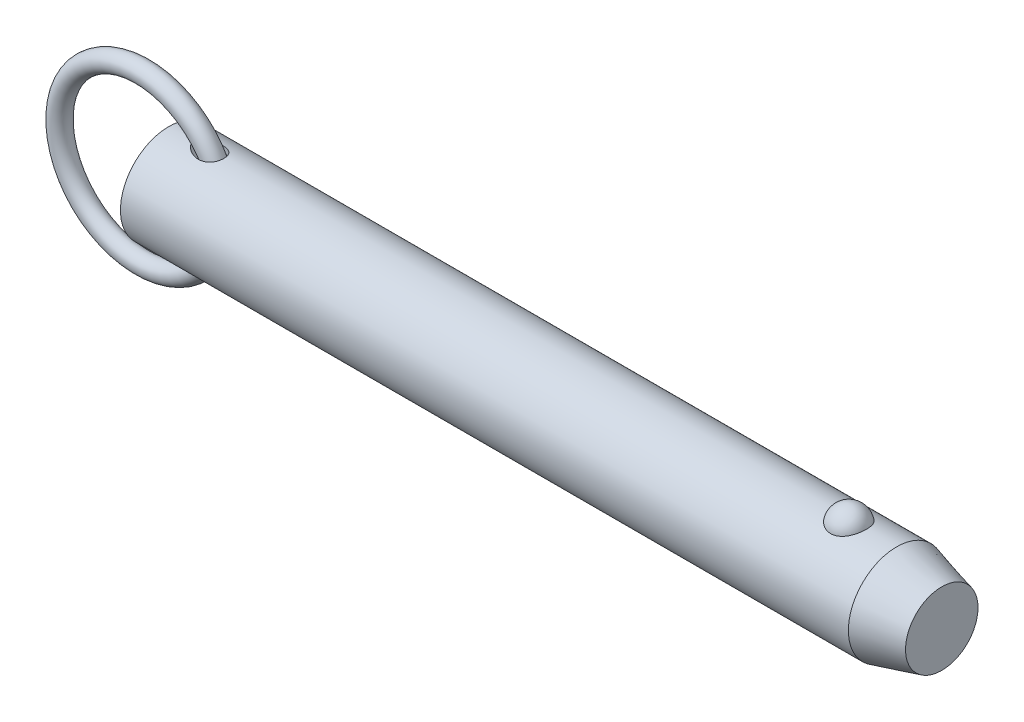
ISO-10303-21;
HEADER;
FILE_DESCRIPTION(('STEP AP214'),'2;1');
FILE_NAME('part.step','',(''),(''),'','','');
FILE_SCHEMA(('AUTOMOTIVE_DESIGN { 1 0 10303 214 1 1 1 1 }'));
ENDSEC;
DATA;
#1=APPLICATION_CONTEXT('core data for automotive mechanical design processes');
#2=APPLICATION_PROTOCOL_DEFINITION('international standard','automotive_design',2000,#1);
#3=PRODUCT_CONTEXT('',#1,'mechanical');
#4=PRODUCT('Part','Part','',(#3));
#5=PRODUCT_RELATED_PRODUCT_CATEGORY('part','',(#4));
#6=PRODUCT_DEFINITION_FORMATION('','',#4);
#7=PRODUCT_DEFINITION_CONTEXT('part definition',#1,'design');
#8=PRODUCT_DEFINITION('design','',#6,#7);
#9=PRODUCT_DEFINITION_SHAPE('','',#8);
#10=(LENGTH_UNIT() NAMED_UNIT(*) SI_UNIT(.MILLI.,.METRE.));
#11=(NAMED_UNIT(*) PLANE_ANGLE_UNIT() SI_UNIT($,.RADIAN.));
#12=(NAMED_UNIT(*) SI_UNIT($,.STERADIAN.) SOLID_ANGLE_UNIT());
#13=UNCERTAINTY_MEASURE_WITH_UNIT(LENGTH_MEASURE(1.E-05),#10,'distance_accuracy_value','');
#14=(GEOMETRIC_REPRESENTATION_CONTEXT(3) GLOBAL_UNCERTAINTY_ASSIGNED_CONTEXT((#13)) GLOBAL_UNIT_ASSIGNED_CONTEXT((#10,
#11,#12)) REPRESENTATION_CONTEXT('',''));
#15=CARTESIAN_POINT('',(0.,0.,0.));
#16=DIRECTION('',(0.,0.,1.));
#17=DIRECTION('',(1.,0.,0.));
#18=AXIS2_PLACEMENT_3D('',#15,#16,#17);
#19=CARTESIAN_POINT('',(-6.08699288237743,0.,0.));
#20=DIRECTION('',(0.,0.,1.));
#21=DIRECTION('',(1.,0.,0.));
#22=AXIS2_PLACEMENT_3D('',#19,#20,#21);
#23=TOROIDAL_SURFACE('',#22,19.05,2.223);
#24=CARTESIAN_POINT('',(15.1860071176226,0.,0.));
#25=VERTEX_POINT('',#24);
#26=VERTEX_LOOP('',#25);
#27=FACE_BOUND('',#26,.T.);
#28=ADVANCED_FACE('P0_F12',(#27),#23,.T.);
#29=CLOSED_SHELL('',(#28));
#30=MANIFOLD_SOLID_BREP('P0_B1',#29);
#31=CARTESIAN_POINT('',(0.,0.,0.));
#32=DIRECTION('',(1.,0.,0.));
#33=DIRECTION('',(0.,0.,-1.));
#34=AXIS2_PLACEMENT_3D('',#31,#32,#33);
#35=CYLINDRICAL_SURFACE('',#34,11.115);
#36=CARTESIAN_POINT('',(6.41405181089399,11.0227946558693,-1.4287136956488));
#37=CARTESIAN_POINT('',(6.49338916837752,11.0115377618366,-1.51556642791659));
#38=CARTESIAN_POINT('',(6.5776546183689,10.9998263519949,-1.59789397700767));
#39=CARTESIAN_POINT('',(6.75386647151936,10.9760304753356,-1.75391400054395));
#40=CARTESIAN_POINT('',(6.84582247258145,10.9639455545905,-1.82759540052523));
#41=CARTESIAN_POINT('',(7.03627827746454,10.9397989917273,-1.96698954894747));
#42=CARTESIAN_POINT('',(7.1348083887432,10.9277377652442,-2.03266078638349));
#43=CARTESIAN_POINT('',(7.33681032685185,10.9041015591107,-2.1558582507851));
#44=CARTESIAN_POINT('',(7.44028007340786,10.8925263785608,-2.21338786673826));
#45=CARTESIAN_POINT('',(7.64386117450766,10.8710104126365,-2.31666528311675));
#46=CARTESIAN_POINT('',(7.74368989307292,10.8610119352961,-2.36295942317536));
#47=CARTESIAN_POINT('',(7.94637195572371,10.8420168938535,-2.44863486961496));
#48=CARTESIAN_POINT('',(8.0492261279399,10.8330206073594,-2.48801426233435));
#49=CARTESIAN_POINT('',(8.3611557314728,10.807980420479,-2.59542730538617));
#50=CARTESIAN_POINT('',(8.57411849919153,10.7938278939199,-2.65299817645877));
#51=CARTESIAN_POINT('',(9.00825016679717,10.7725818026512,-2.73800108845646));
#52=CARTESIAN_POINT('',(9.22947335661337,10.7655491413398,-2.76517330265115));
#53=CARTESIAN_POINT('',(9.6736814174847,10.7605872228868,-2.78445308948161));
#54=CARTESIAN_POINT('',(9.89666486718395,10.7626512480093,-2.77658653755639));
#55=CARTESIAN_POINT('',(10.2950172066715,10.7754452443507,-2.72644436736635));
#56=CARTESIAN_POINT('',(10.4712789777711,10.7844280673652,-2.69109376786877));
#57=CARTESIAN_POINT('',(10.7292776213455,10.8024982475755,-2.61722365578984));
#58=CARTESIAN_POINT('',(10.8142337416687,10.8092901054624,-2.58911576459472));
#59=CARTESIAN_POINT('',(10.9813218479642,10.8242580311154,-2.52581287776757));
#60=CARTESIAN_POINT('',(11.0634550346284,10.8324335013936,-2.49062094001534));
#61=CARTESIAN_POINT('',(11.2247418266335,10.8500287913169,-2.41281958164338));
#62=CARTESIAN_POINT('',(11.3038694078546,10.8594572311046,-2.37015806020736));
#63=CARTESIAN_POINT('',(11.4576781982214,10.8792243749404,-2.27770403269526));
#64=CARTESIAN_POINT('',(11.5323615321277,10.8895626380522,-2.22791497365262));
#65=CARTESIAN_POINT('',(11.6765388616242,10.9108113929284,-2.12140590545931));
#66=CARTESIAN_POINT('',(11.7460329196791,10.9217218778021,-2.06468597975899));
#67=CARTESIAN_POINT('',(11.8790597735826,10.9437207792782,-1.94471764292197));
#68=CARTESIAN_POINT('',(11.9425932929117,10.9548091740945,-1.88147002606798));
#69=CARTESIAN_POINT('',(12.109388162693,10.9851999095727,-1.69784918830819));
#70=CARTESIAN_POINT('',(12.205655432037,11.0042655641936,-1.57093023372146));
#71=CARTESIAN_POINT('',(12.374151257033,11.0393391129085,-1.3017676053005));
#72=CARTESIAN_POINT('',(12.4463875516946,11.0553479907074,-1.15952888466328));
#73=CARTESIAN_POINT('',(12.5615818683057,11.0816338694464,-0.871972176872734));
#74=CARTESIAN_POINT('',(12.6058896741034,11.0921698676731,-0.727217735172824));
#75=CARTESIAN_POINT('',(12.6699315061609,11.1075802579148,-0.432089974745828));
#76=CARTESIAN_POINT('',(12.6896681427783,11.1124552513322,-0.281717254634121));
#77=CARTESIAN_POINT('',(12.704022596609,11.1159901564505,0.0188164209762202));
#78=CARTESIAN_POINT('',(12.6988836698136,11.1147102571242,0.168965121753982));
#79=CARTESIAN_POINT('',(12.6641681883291,11.1062126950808,0.466238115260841));
#80=CARTESIAN_POINT('',(12.6345920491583,11.0989951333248,0.61336245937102));
#81=CARTESIAN_POINT('',(12.5517453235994,11.0794095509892,0.900330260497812));
#82=CARTESIAN_POINT('',(12.4984878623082,11.0670443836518,1.0401777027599));
#83=CARTESIAN_POINT('',(12.3696588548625,11.0385082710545,1.308745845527));
#84=CARTESIAN_POINT('',(12.2940887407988,11.0223375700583,1.43746725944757));
#85=CARTESIAN_POINT('',(12.122380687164,10.987872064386,1.68079704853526));
#86=CARTESIAN_POINT('',(12.0261637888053,10.969569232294,1.79534850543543));
#87=CARTESIAN_POINT('',(11.8161707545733,10.932836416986,2.00695695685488));
#88=CARTESIAN_POINT('',(11.7023941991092,10.9144064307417,2.10401353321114));
#89=CARTESIAN_POINT('',(11.4575656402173,10.8788057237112,2.28105326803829));
#90=CARTESIAN_POINT('',(11.3261451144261,10.8616794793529,2.36053412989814));
#91=CARTESIAN_POINT('',(11.0523589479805,10.8308019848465,2.49839044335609));
#92=CARTESIAN_POINT('',(10.9099908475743,10.8170514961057,2.55676113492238));
#93=CARTESIAN_POINT('',(10.6060622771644,10.7929728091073,2.65666105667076));
#94=CARTESIAN_POINT('',(10.4438877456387,10.7830209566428,2.69640163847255));
#95=CARTESIAN_POINT('',(10.1154037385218,10.7687230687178,2.75293129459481));
#96=CARTESIAN_POINT('',(9.94909141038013,10.7643810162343,2.76970406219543));
#97=CARTESIAN_POINT('',(9.54387061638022,10.7604809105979,2.7848723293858));
#98=CARTESIAN_POINT('',(9.30446860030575,10.7637793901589,2.77227753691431));
#99=CARTESIAN_POINT('',(8.94961255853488,10.7757341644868,2.72524141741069));
#100=CARTESIAN_POINT('',(8.83186896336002,10.7808994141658,2.70482239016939));
#101=CARTESIAN_POINT('',(8.59835142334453,10.7932548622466,2.65509992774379));
#102=CARTESIAN_POINT('',(8.48257728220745,10.8004448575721,2.62579738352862));
#103=CARTESIAN_POINT('',(8.25208469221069,10.8166382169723,2.55827624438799));
#104=CARTESIAN_POINT('',(8.1374021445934,10.8256649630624,2.51994155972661));
#105=CARTESIAN_POINT('',(7.91132058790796,10.8451170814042,2.43486475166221));
#106=CARTESIAN_POINT('',(7.79992154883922,10.8555424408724,2.38812270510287));
#107=CARTESIAN_POINT('',(7.58115677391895,10.8774251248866,2.28638483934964));
#108=CARTESIAN_POINT('',(7.47378802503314,10.8888816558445,2.23139534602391));
#109=CARTESIAN_POINT('',(7.26385624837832,10.9124540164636,2.11310265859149));
#110=CARTESIAN_POINT('',(7.16129168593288,10.9245696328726,2.04980214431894));
#111=CARTESIAN_POINT('',(6.91882218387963,10.9543689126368,1.88540538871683));
#112=CARTESIAN_POINT('',(6.78193778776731,10.9721958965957,1.77979827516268));
#113=CARTESIAN_POINT('',(6.52472441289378,11.0070222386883,1.54989693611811));
#114=CARTESIAN_POINT('',(6.40436902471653,11.0240228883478,1.42563320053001));
#115=CARTESIAN_POINT('',(6.21838804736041,11.0509658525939,1.19529359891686));
#116=CARTESIAN_POINT('',(6.14691885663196,11.0615430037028,1.09404520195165));
#117=CARTESIAN_POINT('',(6.0204349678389,11.0805004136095,0.881508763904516));
#118=CARTESIAN_POINT('',(5.96539400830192,11.0888841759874,0.770237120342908));
#119=CARTESIAN_POINT('',(5.88475453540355,11.1012553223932,0.560577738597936));
#120=CARTESIAN_POINT('',(5.85559643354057,11.1057686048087,0.463603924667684));
#121=CARTESIAN_POINT('',(5.81381299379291,11.1122523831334,0.266083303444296));
#122=CARTESIAN_POINT('',(5.80117118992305,11.1142254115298,0.165540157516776));
#123=CARTESIAN_POINT('',(5.79363815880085,11.1153999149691,-0.0364747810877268));
#124=CARTESIAN_POINT('',(5.79878799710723,11.1145949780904,-0.137948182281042));
#125=CARTESIAN_POINT('',(5.82639592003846,11.1102987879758,-0.338493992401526));
#126=CARTESIAN_POINT('',(5.8488723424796,11.1068046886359,-0.437563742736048));
#127=CARTESIAN_POINT('',(5.91510741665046,11.0965857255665,-0.649968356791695));
#128=CARTESIAN_POINT('',(5.96220905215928,11.0893566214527,-0.7622229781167));
#129=CARTESIAN_POINT('',(6.0737844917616,11.072471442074,-0.977396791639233));
#130=CARTESIAN_POINT('',(6.13826787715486,11.0628140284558,-1.08031079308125));
#131=CARTESIAN_POINT('',(6.24101077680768,11.0477136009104,-1.2219580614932));
#132=CARTESIAN_POINT('',(6.27403486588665,11.042895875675,-1.26469183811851));
#133=CARTESIAN_POINT('',(6.34238022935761,11.0330152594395,-1.34817011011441));
#134=CARTESIAN_POINT('',(6.37769867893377,11.0279526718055,-1.38891694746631));
#135=CARTESIAN_POINT('',(6.41405181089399,11.0227946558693,-1.4287136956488));
#136=B_SPLINE_CURVE_WITH_KNOTS('',3,(#36,#37,#38,#39,#40,#41,#42,#43,#44,#45,#46,#47,#48,#49,
#50,#51,#52,#53,#54,#55,#56,#57,#58,#59,#60,#61,#62,#63,#64,#65,#66,#67,#68,#69,#70,#71,#72,#73,
#74,#75,#76,#77,#78,#79,#80,#81,#82,#83,#84,#85,#86,#87,#88,#89,#90,#91,#92,#93,#94,#95,#96,#97,
#98,#99,#100,#101,#102,#103,#104,#105,#106,#107,#108,#109,#110,#111,#112,#113,#114,#115,#116,
#117,#118,#119,#120,#121,#122,#123,#124,#125,#126,#127,#128,#129,#130,#131,#132,#133,#134,#135),
.UNSPECIFIED.,.T.,.F.,(4,2,2,2,2,2,2,2,2,2,2,2,2,2,2,2,2,2,2,2,2,2,2,2,2,2,2,2,2,2,2,2,2,2,2,2,
2,2,2,2,2,2,2,2,2,2,2,2,2,4),(0.,0.354433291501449,0.709315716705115,1.0659654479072,
1.42246628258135,1.75367157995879,2.08496839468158,2.74582009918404,3.41227815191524,
4.07824412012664,4.61583787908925,4.88478112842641,5.1536085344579,5.42439170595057,
5.69504436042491,5.96569375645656,6.23631025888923,6.71490729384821,7.19335005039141,
7.64641437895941,8.09943057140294,8.54802575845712,8.99661331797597,9.44495256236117,
9.89326303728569,10.3433195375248,10.7933867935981,11.2550086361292,11.7167345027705,
12.2165866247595,12.7167934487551,13.4318876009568,13.7904664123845,14.1490092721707,
14.5124394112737,14.8758662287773,15.239015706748,15.6020483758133,16.1219860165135,
16.6410830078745,17.0130520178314,17.3844231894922,17.6872330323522,17.9897407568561,
18.2929471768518,18.5964749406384,18.9603532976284,19.3244326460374,19.4870338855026,
19.649438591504),.UNSPECIFIED.);
#137=CARTESIAN_POINT('',(6.41405181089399,11.0227946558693,-1.4287136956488));
#138=VERTEX_POINT('',#137);
#139=EDGE_CURVE('P1_E40',#138,#138,#136,.T.);
#140=ORIENTED_EDGE('',*,*,#139,.T.);
#141=EDGE_LOOP('',(#140));
#142=FACE_BOUND('',#141,.T.);
#143=CARTESIAN_POINT('',(167.429563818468,0.,0.));
#144=DIRECTION('',(1.,0.,0.));
#145=DIRECTION('',(0.,0.,-1.));
#146=AXIS2_PLACEMENT_3D('',#143,#144,#145);
#147=CIRCLE('',#146,11.115);
#148=CARTESIAN_POINT('',(167.429563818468,0.,-11.115));
#149=VERTEX_POINT('',#148);
#150=EDGE_CURVE('P1_E25',#149,#149,#147,.T.);
#151=ORIENTED_EDGE('',*,*,#150,.F.);
#152=EDGE_LOOP('',(#151));
#153=FACE_BOUND('',#152,.T.);
#154=CARTESIAN_POINT('',(0.,0.,0.));
#155=DIRECTION('',(1.,0.,0.));
#156=DIRECTION('',(0.,0.,-1.));
#157=AXIS2_PLACEMENT_3D('',#154,#155,#156);
#158=CIRCLE('',#157,11.115);
#159=CARTESIAN_POINT('',(0.,0.,-11.115));
#160=VERTEX_POINT('',#159);
#161=EDGE_CURVE('P1_E9',#160,#160,#158,.T.);
#162=ORIENTED_EDGE('',*,*,#161,.T.);
#163=EDGE_LOOP('',(#162));
#164=FACE_BOUND('',#163,.T.);
#165=CARTESIAN_POINT('',(156.431068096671,10.3028087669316,4.17077409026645));
#166=CARTESIAN_POINT('',(156.214775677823,10.3028003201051,4.17078240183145));
#167=CARTESIAN_POINT('',(155.998548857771,10.3098895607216,4.15340593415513));
#168=CARTESIAN_POINT('',(155.572540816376,10.3373834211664,4.08449540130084));
#169=CARTESIAN_POINT('',(155.362757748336,10.3577841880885,4.03297121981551));
#170=CARTESIAN_POINT('',(154.955782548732,10.4095237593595,3.89746513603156));
#171=CARTESIAN_POINT('',(154.758572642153,10.4408466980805,3.81353029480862));
#172=CARTESIAN_POINT('',(154.381338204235,10.5110236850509,3.61560339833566));
#173=CARTESIAN_POINT('',(154.201317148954,10.5498792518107,3.50160528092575));
#174=CARTESIAN_POINT('',(153.857684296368,10.6322884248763,3.24292464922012));
#175=CARTESIAN_POINT('',(153.694686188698,10.6759443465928,3.09746040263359));
#176=CARTESIAN_POINT('',(153.394591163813,10.7625291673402,2.7817192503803));
#177=CARTESIAN_POINT('',(153.257499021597,10.8054579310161,2.61143778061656));
#178=CARTESIAN_POINT('',(153.006408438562,10.8881935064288,2.24226695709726));
#179=CARTESIAN_POINT('',(152.893710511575,10.9277761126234,2.04244123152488));
#180=CARTESIAN_POINT('',(152.701777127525,10.997484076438,1.62578254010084));
#181=CARTESIAN_POINT('',(152.622544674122,11.0276085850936,1.40894804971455));
#182=CARTESIAN_POINT('',(152.498303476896,11.0756732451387,0.961250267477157));
#183=CARTESIAN_POINT('',(152.453760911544,11.0934470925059,0.730239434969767));
#184=CARTESIAN_POINT('',(152.401569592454,11.1143331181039,0.263439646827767));
#185=CARTESIAN_POINT('',(152.393920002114,11.1174456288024,0.0276507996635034));
#186=CARTESIAN_POINT('',(152.41561056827,11.1087161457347,-0.44072963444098));
#187=CARTESIAN_POINT('',(152.444762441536,11.0969502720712,-0.673331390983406));
#188=CARTESIAN_POINT('',(152.539143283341,11.0597872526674,-1.12996621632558));
#189=CARTESIAN_POINT('',(152.604372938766,11.0343898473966,-1.35399912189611));
#190=CARTESIAN_POINT('',(152.76969844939,10.972515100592,-1.78750286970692));
#191=CARTESIAN_POINT('',(152.86983863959,10.9360236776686,-1.99695478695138));
#192=CARTESIAN_POINT('',(153.102940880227,10.8557595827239,-2.39520667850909));
#193=CARTESIAN_POINT('',(153.235905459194,10.8119863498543,-2.5840050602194));
#194=CARTESIAN_POINT('',(153.532407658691,10.7216733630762,-2.93635726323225));
#195=CARTESIAN_POINT('',(153.696056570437,10.675123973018,-3.09981510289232));
#196=CARTESIAN_POINT('',(154.049860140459,10.5846571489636,-3.39592247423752));
#197=CARTESIAN_POINT('',(154.240012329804,10.5407394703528,-3.52857487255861));
#198=CARTESIAN_POINT('',(154.63750141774,10.4616690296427,-3.75646057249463));
#199=CARTESIAN_POINT('',(154.84436705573,10.4263443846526,-3.85245432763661));
#200=CARTESIAN_POINT('',(155.272954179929,10.3675574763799,-4.00798747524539));
#201=CARTESIAN_POINT('',(155.494670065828,10.344090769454,-4.0675405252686));
#202=CARTESIAN_POINT('',(155.934669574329,10.3128282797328,-4.14614314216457));
#203=CARTESIAN_POINT('',(156.152565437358,10.3043040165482,-4.1670783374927));
#204=CARTESIAN_POINT('',(156.58894951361,10.3016771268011,-4.17357158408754));
#205=CARTESIAN_POINT('',(156.807437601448,10.3075716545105,-4.15913661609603));
#206=CARTESIAN_POINT('',(157.231744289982,10.3326686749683,-4.09636961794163));
#207=CARTESIAN_POINT('',(157.437745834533,10.3514555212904,-4.0490957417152));
#208=CARTESIAN_POINT('',(157.838576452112,10.399818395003,-3.92320197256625));
#209=CARTESIAN_POINT('',(158.0334046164,10.4293952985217,-3.84457953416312));
#210=CARTESIAN_POINT('',(158.411191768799,10.4969600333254,-3.65612410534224));
#211=CARTESIAN_POINT('',(158.593797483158,10.5351178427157,-3.54564545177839));
#212=CARTESIAN_POINT('',(158.938204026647,10.6154999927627,-3.29718036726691));
#213=CARTESIAN_POINT('',(159.100000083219,10.657725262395,-3.15918764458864));
#214=CARTESIAN_POINT('',(159.406959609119,10.744212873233,-2.85163580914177));
#215=CARTESIAN_POINT('',(159.550891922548,10.7884718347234,-2.68084605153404));
#216=CARTESIAN_POINT('',(159.809237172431,10.872374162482,-2.31721864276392));
#217=CARTESIAN_POINT('',(159.923644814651,10.9120167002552,-2.12437704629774));
#218=CARTESIAN_POINT('',(160.123873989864,10.9838919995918,-1.71516999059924));
#219=CARTESIAN_POINT('',(160.20866178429,11.0158465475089,-1.49824866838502));
#220=CARTESIAN_POINT('',(160.34268382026,11.0673523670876,-1.05228572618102));
#221=CARTESIAN_POINT('',(160.391917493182,11.086903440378,-0.82324391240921));
#222=CARTESIAN_POINT('',(160.453891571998,11.1116323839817,-0.359087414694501));
#223=CARTESIAN_POINT('',(160.466566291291,11.1167843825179,-0.123962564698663));
#224=CARTESIAN_POINT('',(160.454973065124,11.1121144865,0.345220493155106));
#225=CARTESIAN_POINT('',(160.430705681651,11.1022928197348,0.57927871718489));
#226=CARTESIAN_POINT('',(160.345907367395,11.0687504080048,1.03866534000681));
#227=CARTESIAN_POINT('',(160.285529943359,11.0450885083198,1.26402641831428));
#228=CARTESIAN_POINT('',(160.129853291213,10.9863185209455,1.70076772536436));
#229=CARTESIAN_POINT('',(160.034551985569,10.9512097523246,1.91214712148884));
#230=CARTESIAN_POINT('',(159.810397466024,10.8729733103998,2.31608359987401));
#231=CARTESIAN_POINT('',(159.681380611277,10.8298068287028,2.50854240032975));
#232=CARTESIAN_POINT('',(159.392732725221,10.7401896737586,2.86808766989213));
#233=CARTESIAN_POINT('',(159.233102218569,10.6937390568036,3.03517457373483));
#234=CARTESIAN_POINT('',(158.887534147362,10.6029321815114,3.33857581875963));
#235=CARTESIAN_POINT('',(158.701708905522,10.5585680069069,3.47501541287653));
#236=CARTESIAN_POINT('',(158.307875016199,10.4769321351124,3.71390897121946));
#237=CARTESIAN_POINT('',(158.099863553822,10.439661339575,3.81635861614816));
#238=CARTESIAN_POINT('',(157.654066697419,10.3749407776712,3.98910631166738));
#239=CARTESIAN_POINT('',(157.415234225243,10.3482457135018,4.05700929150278));
#240=CARTESIAN_POINT('',(156.927925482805,10.312188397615,4.14782844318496));
#241=CARTESIAN_POINT('',(156.679453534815,10.3028184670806,4.17076454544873));
#242=CARTESIAN_POINT('',(156.431068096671,10.3028087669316,4.17077409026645));
#243=B_SPLINE_CURVE_WITH_KNOTS('',3,(#165,#166,#167,#168,#169,#170,#171,#172,#173,#174,#175,
#176,#177,#178,#179,#180,#181,#182,#183,#184,#185,#186,#187,#188,#189,#190,#191,#192,#193,#194,
#195,#196,#197,#198,#199,#200,#201,#202,#203,#204,#205,#206,#207,#208,#209,#210,#211,#212,#213,
#214,#215,#216,#217,#218,#219,#220,#221,#222,#223,#224,#225,#226,#227,#228,#229,#230,#231,#232,
#233,#234,#235,#236,#237,#238,#239,#240,#241,#242),.UNSPECIFIED.,.T.,.F.,(4,2,2,2,2,2,2,2,2,2,2,
2,2,2,2,2,2,2,2,2,2,2,2,2,2,2,2,2,2,2,2,2,2,2,2,2,2,2,4),(0.,0.647966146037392,1.29574482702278,
1.9425864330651,2.58955857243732,3.25496465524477,3.92049326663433,4.61566368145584,
5.31089647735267,6.01531821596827,6.71972398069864,7.42054043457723,8.12137023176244,
8.8230933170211,9.52487047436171,10.2292439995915,10.9335519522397,11.6223330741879,
12.3108558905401,12.96476640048,13.6185478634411,14.252184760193,14.8858731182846,
15.5334360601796,16.1811472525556,16.8611459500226,17.5412664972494,18.2431855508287,
18.9451158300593,19.6483065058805,20.3514864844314,21.0516982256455,21.7519516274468,
22.4556690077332,23.1593743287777,23.8601491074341,24.5610129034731,25.3054529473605,
26.049562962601),.UNSPECIFIED.);
#244=CARTESIAN_POINT('',(156.431068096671,10.3028087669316,4.17077409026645));
#245=VERTEX_POINT('',#244);
#246=EDGE_CURVE('P1_E34',#245,#245,#243,.T.);
#247=ORIENTED_EDGE('',*,*,#246,.T.);
#248=EDGE_LOOP('',(#247));
#249=FACE_BOUND('',#248,.T.);
#250=CARTESIAN_POINT('',(6.41405181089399,-11.0227946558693,-1.4287136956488));
#251=CARTESIAN_POINT('',(6.3312406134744,-11.0345445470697,-1.33806125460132));
#252=CARTESIAN_POINT('',(6.25372866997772,-11.0458090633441,-1.24240732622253));
#253=CARTESIAN_POINT('',(6.11277905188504,-11.0666115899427,-1.04095704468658));
#254=CARTESIAN_POINT('',(6.04933920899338,-11.0761498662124,-0.935162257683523));
#255=CARTESIAN_POINT('',(5.94029181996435,-11.0927063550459,-0.712476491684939));
#256=CARTESIAN_POINT('',(5.89492964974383,-11.0996897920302,-0.595457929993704));
#257=CARTESIAN_POINT('',(5.84498161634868,-11.1074141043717,-0.414997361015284));
#258=CARTESIAN_POINT('',(5.83135004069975,-11.1095300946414,-0.354047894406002));
#259=CARTESIAN_POINT('',(5.81051649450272,-11.1127688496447,-0.231041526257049));
#260=CARTESIAN_POINT('',(5.80331311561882,-11.1138918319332,-0.1689848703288));
#261=CARTESIAN_POINT('',(5.7929652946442,-11.1155042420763,-0.000484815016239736));
#262=CARTESIAN_POINT('',(5.79625267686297,-11.1149904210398,0.106437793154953));
#263=CARTESIAN_POINT('',(5.82213676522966,-11.1109609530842,0.317809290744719));
#264=CARTESIAN_POINT('',(5.84474662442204,-11.1074432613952,0.422256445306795));
#265=CARTESIAN_POINT('',(5.911131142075,-11.097197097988,0.63936180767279));
#266=CARTESIAN_POINT('',(5.95733120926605,-11.090102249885,0.751250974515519));
#267=CARTESIAN_POINT('',(6.06709542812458,-11.0734770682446,0.965912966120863));
#268=CARTESIAN_POINT('',(6.13068735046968,-11.06394284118,1.06867085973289));
#269=CARTESIAN_POINT('',(6.30294237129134,-11.0385920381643,1.30890635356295));
#270=CARTESIAN_POINT('',(6.41896200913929,-11.0218881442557,1.44097376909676));
#271=CARTESIAN_POINT('',(6.66989654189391,-10.9871512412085,1.68553954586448));
#272=CARTESIAN_POINT('',(6.80485520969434,-10.9691152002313,1.79799117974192));
#273=CARTESIAN_POINT('',(7.04881236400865,-10.9382283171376,1.97587596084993));
#274=CARTESIAN_POINT('',(7.15465712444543,-10.9253240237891,2.04570822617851));
#275=CARTESIAN_POINT('',(7.37202504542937,-10.9000987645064,2.17611840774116));
#276=CARTESIAN_POINT('',(7.48355057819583,-10.8877780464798,2.23669241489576));
#277=CARTESIAN_POINT('',(7.71132418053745,-10.8641580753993,2.34873831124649));
#278=CARTESIAN_POINT('',(7.82757727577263,-10.8528599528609,2.40020018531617));
#279=CARTESIAN_POINT('',(8.06386825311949,-10.8317234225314,2.49385169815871));
#280=CARTESIAN_POINT('',(8.18390558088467,-10.8218848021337,2.53604268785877));
#281=CARTESIAN_POINT('',(8.42918336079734,-10.8039208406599,2.61152283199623));
#282=CARTESIAN_POINT('',(8.55447802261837,-10.7958283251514,2.64464414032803));
#283=CARTESIAN_POINT('',(8.8075212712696,-10.781995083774,2.70048793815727));
#284=CARTESIAN_POINT('',(8.93527019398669,-10.7762546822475,2.72320899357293));
#285=CARTESIAN_POINT('',(9.19210176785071,-10.7675291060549,2.75750994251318));
#286=CARTESIAN_POINT('',(9.32118105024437,-10.7645381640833,2.76911315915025));
#287=CARTESIAN_POINT('',(9.57984338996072,-10.761622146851,2.78042035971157));
#288=CARTESIAN_POINT('',(9.70942621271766,-10.7616957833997,2.78012934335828));
#289=CARTESIAN_POINT('',(10.0243125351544,-10.7659059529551,2.76381534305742));
#290=CARTESIAN_POINT('',(10.209307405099,-10.7717977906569,2.74099674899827));
#291=CARTESIAN_POINT('',(10.5731188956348,-10.7905408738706,2.66626238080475));
#292=CARTESIAN_POINT('',(10.7519389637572,-10.8033881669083,2.61436313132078));
#293=CARTESIAN_POINT('',(11.0114289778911,-10.8271584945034,2.51336808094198));
#294=CARTESIAN_POINT('',(11.096831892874,-10.835881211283,2.47562331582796));
#295=CARTESIAN_POINT('',(11.2636000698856,-10.8545688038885,2.39236170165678));
#296=CARTESIAN_POINT('',(11.3449673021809,-10.8645330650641,2.3468486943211));
#297=CARTESIAN_POINT('',(11.5027832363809,-10.8853818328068,2.24815967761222));
#298=CARTESIAN_POINT('',(11.5792327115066,-10.8962661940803,2.19498487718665));
#299=CARTESIAN_POINT('',(11.7263315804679,-10.9185541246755,2.08128855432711));
#300=CARTESIAN_POINT('',(11.7969818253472,-10.9299576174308,2.02076811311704));
#301=CARTESIAN_POINT('',(11.9817953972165,-10.9613645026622,1.84513663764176));
#302=CARTESIAN_POINT('',(12.0893012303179,-10.9814643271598,1.72286660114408));
#303=CARTESIAN_POINT('',(12.2803576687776,-11.0193991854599,1.46066991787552));
#304=CARTESIAN_POINT('',(12.3639173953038,-11.0372350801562,1.3207500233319));
#305=CARTESIAN_POINT('',(12.4996220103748,-11.0672969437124,1.03778067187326));
#306=CARTESIAN_POINT('',(12.5535315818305,-11.0798242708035,0.895607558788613));
#307=CARTESIAN_POINT('',(12.636874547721,-11.0995427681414,0.603918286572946));
#308=CARTESIAN_POINT('',(12.6663115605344,-11.1067347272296,0.454403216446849));
#309=CARTESIAN_POINT('',(12.6997387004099,-11.1149224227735,0.154577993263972));
#310=CARTESIAN_POINT('',(12.7040886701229,-11.1160057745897,0.00431019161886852));
#311=CARTESIAN_POINT('',(12.6882048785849,-11.1120956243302,-0.294841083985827));
#312=CARTESIAN_POINT('',(12.6679715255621,-11.1071022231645,-0.443724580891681));
#313=CARTESIAN_POINT('',(12.6034470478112,-11.0915888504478,-0.735688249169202));
#314=CARTESIAN_POINT('',(12.5591858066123,-11.0810757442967,-0.878775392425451));
#315=CARTESIAN_POINT('',(12.4477416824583,-11.0556687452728,-1.15529525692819));
#316=CARTESIAN_POINT('',(12.3805601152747,-11.0407751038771,-1.2887285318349));
#317=CARTESIAN_POINT('',(12.2248919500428,-11.0081839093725,-1.54257976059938));
#318=CARTESIAN_POINT('',(12.1363549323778,-10.9904797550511,-1.66296592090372));
#319=CARTESIAN_POINT('',(11.9406137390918,-10.9541951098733,-1.88726577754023));
#320=CARTESIAN_POINT('',(11.833409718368,-10.9356146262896,-1.99117961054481));
#321=CARTESIAN_POINT('',(11.601318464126,-10.8991360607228,-2.18213646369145));
#322=CARTESIAN_POINT('',(11.4761325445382,-10.8812577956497,-2.26881927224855));
#323=CARTESIAN_POINT('',(11.2134852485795,-10.8482871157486,-2.42157282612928));
#324=CARTESIAN_POINT('',(11.0760218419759,-10.8331951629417,-2.48764015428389));
#325=CARTESIAN_POINT('',(10.7828968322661,-10.8061050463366,-2.60290068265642));
#326=CARTESIAN_POINT('',(10.6266338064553,-10.7943907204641,-2.65062248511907));
#327=CARTESIAN_POINT('',(10.3086617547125,-10.7762429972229,-2.72345054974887));
#328=CARTESIAN_POINT('',(10.146948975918,-10.7698133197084,-2.74854088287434));
#329=CARTESIAN_POINT('',(9.75541304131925,-10.7608036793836,-2.78368719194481));
#330=CARTESIAN_POINT('',(9.52459435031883,-10.7608467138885,-2.78350276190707));
#331=CARTESIAN_POINT('',(9.0660496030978,-10.7702674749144,-2.74677945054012));
#332=CARTESIAN_POINT('',(8.83832966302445,-10.7796615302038,-2.71017697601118));
#333=CARTESIAN_POINT('',(8.38783466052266,-10.8058248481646,-2.60392490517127));
#334=CARTESIAN_POINT('',(8.16517101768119,-10.8226939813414,-2.53382676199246));
#335=CARTESIAN_POINT('',(7.84087311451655,-10.8516548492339,-2.40555545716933));
#336=CARTESIAN_POINT('',(7.73435551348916,-10.8619221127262,-2.35892455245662));
#337=CARTESIAN_POINT('',(7.52510420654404,-10.883357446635,-2.25797017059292));
#338=CARTESIAN_POINT('',(7.42236986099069,-10.8945253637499,-2.20364800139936));
#339=CARTESIAN_POINT('',(7.23808758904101,-10.915528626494,-2.09688018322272));
#340=CARTESIAN_POINT('',(7.15584631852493,-10.9252787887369,-2.04561072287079));
#341=CARTESIAN_POINT('',(6.99510576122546,-10.944960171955,-1.93754729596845));
#342=CARTESIAN_POINT('',(6.91660574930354,-10.9548913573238,-1.88075440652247));
#343=CARTESIAN_POINT('',(6.76418133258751,-10.974690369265,-1.7615450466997));
#344=CARTESIAN_POINT('',(6.69024940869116,-10.984558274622,-1.69913825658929));
#345=CARTESIAN_POINT('',(6.54780119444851,-11.0039826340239,-1.56842485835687));
#346=CARTESIAN_POINT('',(6.47928247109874,-11.0135392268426,-1.50012092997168));
#347=CARTESIAN_POINT('',(6.41405181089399,-11.0227946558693,-1.4287136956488));
#348=B_SPLINE_CURVE_WITH_KNOTS('',3,(#250,#251,#252,#253,#254,#255,#256,#257,#258,#259,#260,
#261,#262,#263,#264,#265,#266,#267,#268,#269,#270,#271,#272,#273,#274,#275,#276,#277,#278,#279,
#280,#281,#282,#283,#284,#285,#286,#287,#288,#289,#290,#291,#292,#293,#294,#295,#296,#297,#298,
#299,#300,#301,#302,#303,#304,#305,#306,#307,#308,#309,#310,#311,#312,#313,#314,#315,#316,#317,
#318,#319,#320,#321,#322,#323,#324,#325,#326,#327,#328,#329,#330,#331,#332,#333,#334,#335,#336,
#337,#338,#339,#340,#341,#342,#343,#344,#345,#346,#347),.UNSPECIFIED.,.T.,.F.,(4,2,2,2,2,2,2,2,
2,2,2,2,2,2,2,2,2,2,2,2,2,2,2,2,2,2,2,2,2,2,2,2,2,2,2,2,2,2,2,2,2,2,2,2,2,2,2,2,4),(0.,
0.36983565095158,0.739614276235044,1.1142538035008,1.30141910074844,1.48854338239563,
1.8074587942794,2.12659146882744,2.4883888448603,2.85076733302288,3.3776216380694,
3.90571433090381,4.287639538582,4.66972556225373,5.05222896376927,5.43467659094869,
5.82378546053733,6.21294796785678,6.6012922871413,6.98947336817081,7.54669558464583,
8.10360148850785,8.38458539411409,8.66543074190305,8.94623182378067,9.22699162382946,
9.7162888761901,10.2053995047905,10.6608871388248,11.1163074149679,11.5651786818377,
12.0140424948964,12.4623493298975,12.9106304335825,13.3599804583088,13.8093267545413,
14.2672570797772,14.7252632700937,15.214740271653,15.7045615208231,16.3932594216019,
17.083162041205,17.7825738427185,18.1325177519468,18.4824022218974,18.7744056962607,
19.0663523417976,19.3578048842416,19.6491256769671),.UNSPECIFIED.);
#349=CARTESIAN_POINT('',(6.41405181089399,-11.0227946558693,-1.4287136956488));
#350=VERTEX_POINT('',#349);
#351=EDGE_CURVE('P1_E17',#350,#350,#348,.T.);
#352=ORIENTED_EDGE('',*,*,#351,.T.);
#353=EDGE_LOOP('',(#352));
#354=FACE_BOUND('',#353,.T.);
#355=ADVANCED_FACE('P1_F13',(#142,#153,#164,#249,#354),#35,.T.);
#356=CARTESIAN_POINT('',(0.,0.,0.));
#357=DIRECTION('',(-1.,0.,0.));
#358=DIRECTION('',(0.,0.,1.));
#359=AXIS2_PLACEMENT_3D('',#356,#357,#358);
#360=PLANE('',#359);
#361=ORIENTED_EDGE('',*,*,#161,.F.);
#362=EDGE_LOOP('',(#361));
#363=FACE_BOUND('',#362,.T.);
#364=ADVANCED_FACE('P1_F15',(#363),#360,.T.);
#365=CARTESIAN_POINT('',(177.8,0.,0.));
#366=DIRECTION('',(-1.,0.,0.));
#367=DIRECTION('',(0.,0.,1.));
#368=AXIS2_PLACEMENT_3D('',#365,#366,#367);
#369=CONICAL_SURFACE('',#368,8.33625000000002,0.26179938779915);
#370=ORIENTED_EDGE('',*,*,#150,.T.);
#371=EDGE_LOOP('',(#370));
#372=FACE_BOUND('',#371,.T.);
#373=CARTESIAN_POINT('',(177.8,0.,0.));
#374=DIRECTION('',(1.,0.,0.));
#375=DIRECTION('',(0.,0.,-1.));
#376=AXIS2_PLACEMENT_3D('',#373,#374,#375);
#377=CIRCLE('',#376,8.33625000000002);
#378=CARTESIAN_POINT('',(177.8,0.,-8.33625000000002));
#379=VERTEX_POINT('',#378);
#380=EDGE_CURVE('P1_E30',#379,#379,#377,.T.);
#381=ORIENTED_EDGE('',*,*,#380,.F.);
#382=EDGE_LOOP('',(#381));
#383=FACE_BOUND('',#382,.T.);
#384=ADVANCED_FACE('P1_F55',(#372,#383),#369,.T.);
#385=CARTESIAN_POINT('',(177.8,8.33625000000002,0.));
#386=DIRECTION('',(1.,0.,0.));
#387=DIRECTION('',(0.,0.,-1.));
#388=AXIS2_PLACEMENT_3D('',#385,#386,#387);
#389=PLANE('',#388);
#390=ORIENTED_EDGE('',*,*,#380,.T.);
#391=EDGE_LOOP('',(#390));
#392=FACE_BOUND('',#391,.T.);
#393=ADVANCED_FACE('P1_F51',(#392),#389,.T.);
#394=CARTESIAN_POINT('',(156.431068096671,10.0035,0.));
#395=DIRECTION('',(-1.,0.,0.));
#396=DIRECTION('',(0.,1.,0.));
#397=AXIS2_PLACEMENT_3D('',#394,#395,#396);
#398=SPHERICAL_SURFACE('',#397,4.18150000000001);
#399=ORIENTED_EDGE('',*,*,#246,.F.);
#400=EDGE_LOOP('',(#399));
#401=FACE_BOUND('',#400,.T.);
#402=ADVANCED_FACE('P1_F46',(#401),#398,.T.);
#403=CARTESIAN_POINT('',(-6.08699288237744,0.,0.));
#404=DIRECTION('',(0.,0.,1.));
#405=DIRECTION('',(1.,0.,0.));
#406=AXIS2_PLACEMENT_3D('',#403,#404,#405);
#407=TOROIDAL_SURFACE('',#406,19.05,2.77875);
#408=ORIENTED_EDGE('',*,*,#351,.F.);
#409=EDGE_LOOP('',(#408));
#410=FACE_BOUND('',#409,.T.);
#411=ORIENTED_EDGE('',*,*,#139,.F.);
#412=EDGE_LOOP('',(#411));
#413=FACE_BOUND('',#412,.T.);
#414=ADVANCED_FACE('P1_F50',(#410,#413),#407,.F.);
#415=CLOSED_SHELL('',(#355,#364,#384,#393,#402,#414));
#416=MANIFOLD_SOLID_BREP('P1_B1',#415);
#417=ADVANCED_BREP_SHAPE_REPRESENTATION('',(#18,#30,#416),#14);
#418=SHAPE_DEFINITION_REPRESENTATION(#9,#417);
ENDSEC;
END-ISO-10303-21;
